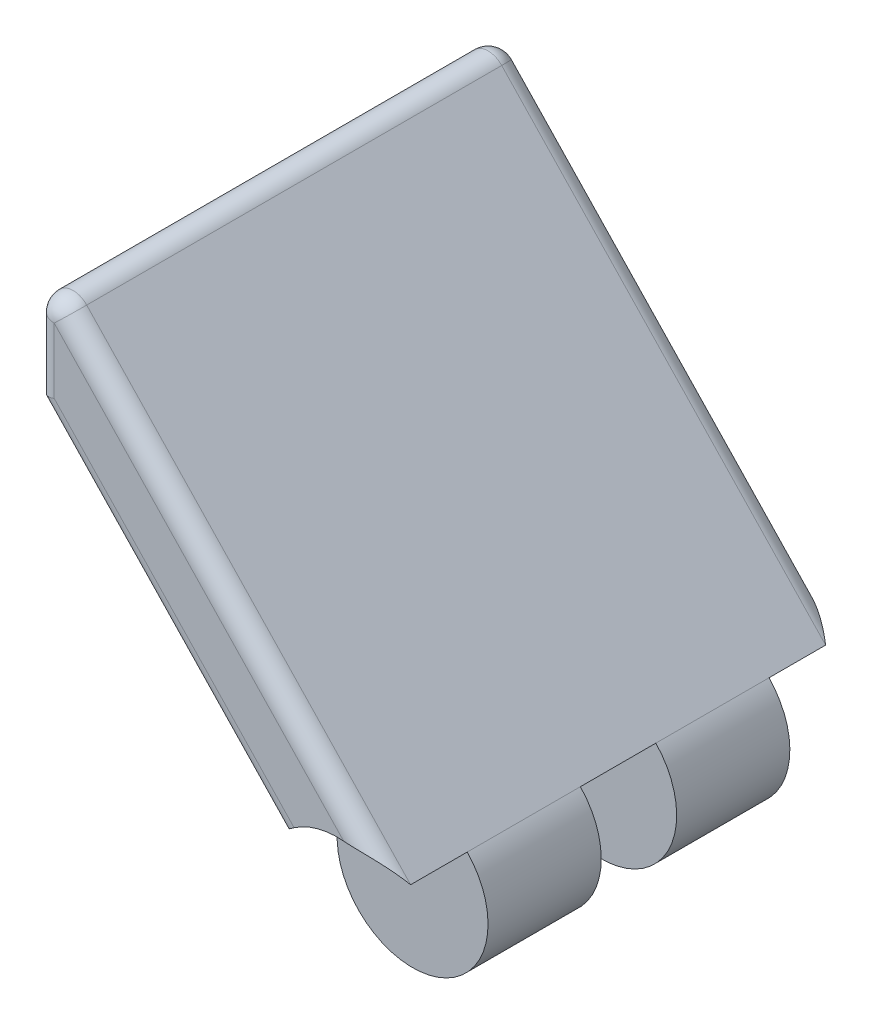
ISO-10303-21;
HEADER;
FILE_DESCRIPTION(('STEP AP214'),'2;1');
FILE_NAME('part.step','',(''),(''),'','','');
FILE_SCHEMA(('AUTOMOTIVE_DESIGN { 1 0 10303 214 1 1 1 1 }'));
ENDSEC;
DATA;
#1=APPLICATION_CONTEXT('core data for automotive mechanical design processes');
#2=APPLICATION_PROTOCOL_DEFINITION('international standard','automotive_design',2000,#1);
#3=PRODUCT_CONTEXT('',#1,'mechanical');
#4=PRODUCT('Part','Part','',(#3));
#5=PRODUCT_RELATED_PRODUCT_CATEGORY('part','',(#4));
#6=PRODUCT_DEFINITION_FORMATION('','',#4);
#7=PRODUCT_DEFINITION_CONTEXT('part definition',#1,'design');
#8=PRODUCT_DEFINITION('design','',#6,#7);
#9=PRODUCT_DEFINITION_SHAPE('','',#8);
#10=(LENGTH_UNIT() NAMED_UNIT(*) SI_UNIT(.MILLI.,.METRE.));
#11=(NAMED_UNIT(*) PLANE_ANGLE_UNIT() SI_UNIT($,.RADIAN.));
#12=(NAMED_UNIT(*) SI_UNIT($,.STERADIAN.) SOLID_ANGLE_UNIT());
#13=UNCERTAINTY_MEASURE_WITH_UNIT(LENGTH_MEASURE(1.E-05),#10,'distance_accuracy_value','');
#14=(GEOMETRIC_REPRESENTATION_CONTEXT(3) GLOBAL_UNCERTAINTY_ASSIGNED_CONTEXT((#13)) GLOBAL_UNIT_ASSIGNED_CONTEXT((#10,
#11,#12)) REPRESENTATION_CONTEXT('',''));
#15=CARTESIAN_POINT('',(0.,0.,0.));
#16=DIRECTION('',(0.,0.,1.));
#17=DIRECTION('',(1.,0.,0.));
#18=AXIS2_PLACEMENT_3D('',#15,#16,#17);
#19=CARTESIAN_POINT('',(98.5993510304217,228.596126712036,15.24));
#20=DIRECTION('',(0.,0.,-1.));
#21=DIRECTION('',(-1.,0.,0.));
#22=AXIS2_PLACEMENT_3D('',#19,#20,#21);
#23=CYLINDRICAL_SURFACE('',#22,5.08000000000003);
#24=CARTESIAN_POINT('',(98.5993510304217,228.596126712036,10.16));
#25=DIRECTION('',(0.,0.,1.));
#26=DIRECTION('',(1.,0.,0.));
#27=AXIS2_PLACEMENT_3D('',#24,#25,#26);
#28=CIRCLE('',#27,5.08000000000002);
#29=CARTESIAN_POINT('',(94.7579757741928,231.920316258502,10.16));
#30=VERTEX_POINT('',#29);
#31=CARTESIAN_POINT('',(102.277439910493,232.100133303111,10.16));
#32=VERTEX_POINT('',#31);
#33=EDGE_CURVE('E140',#30,#32,#28,.T.);
#34=ORIENTED_EDGE('',*,*,#33,.F.);
#35=DIRECTION('',(0.,0.,-1.));
#36=VECTOR('',#35,1.);
#37=CARTESIAN_POINT('',(94.7579757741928,231.920316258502,15.24));
#38=LINE('',#37,#36);
#39=CARTESIAN_POINT('',(94.7579757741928,231.920316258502,2.54));
#40=VERTEX_POINT('',#39);
#41=EDGE_CURVE('E58',#30,#40,#38,.T.);
#42=ORIENTED_EDGE('',*,*,#41,.T.);
#43=CARTESIAN_POINT('',(98.5993510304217,228.596126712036,2.54));
#44=DIRECTION('',(0.,0.,1.));
#45=DIRECTION('',(1.,0.,0.));
#46=AXIS2_PLACEMENT_3D('',#43,#44,#45);
#47=CIRCLE('',#46,5.08000000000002);
#48=CARTESIAN_POINT('',(102.277439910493,232.100133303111,2.54));
#49=VERTEX_POINT('',#48);
#50=EDGE_CURVE('E259',#40,#49,#47,.T.);
#51=ORIENTED_EDGE('',*,*,#50,.T.);
#52=DIRECTION('',(0.,0.,-1.));
#53=VECTOR('',#52,1.);
#54=CARTESIAN_POINT('',(102.277439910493,232.100133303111,15.24));
#55=LINE('',#54,#53);
#56=EDGE_CURVE('E161',#32,#49,#55,.T.);
#57=ORIENTED_EDGE('',*,*,#56,.F.);
#58=EDGE_LOOP('',(#34,#42,#51,#57));
#59=FACE_BOUND('',#58,.T.);
#60=ADVANCED_FACE('F30',(#59),#23,.T.);
#61=CARTESIAN_POINT('',(98.5993510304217,228.596126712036,15.24));
#62=DIRECTION('',(0.,0.,1.));
#63=DIRECTION('',(1.,0.,0.));
#64=AXIS2_PLACEMENT_3D('',#61,#62,#63);
#65=PLANE('',#64);
#66=DIRECTION('',(0.689765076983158,-0.724033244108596,0.));
#67=VECTOR('',#66,1.);
#68=CARTESIAN_POINT('',(95.6774979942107,232.79631790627,15.24));
#69=LINE('',#68,#67);
#70=CARTESIAN_POINT('',(79.5493510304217,249.725726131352,15.24));
#71=VERTEX_POINT('',#70);
#72=CARTESIAN_POINT('',(95.7029932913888,232.769555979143,15.24));
#73=VERTEX_POINT('',#72);
#74=EDGE_CURVE('E183',#71,#73,#69,.T.);
#75=ORIENTED_EDGE('',*,*,#74,.T.);
#76=CARTESIAN_POINT('',(98.5993510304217,228.596126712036,15.24));
#77=DIRECTION('',(0.,0.,1.));
#78=DIRECTION('',(1.,0.,0.));
#79=AXIS2_PLACEMENT_3D('',#76,#77,#78);
#80=CIRCLE('',#79,5.08000000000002);
#81=CARTESIAN_POINT('',(99.040235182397,233.656958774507,15.24));
#82=VERTEX_POINT('',#81);
#83=EDGE_CURVE('E244',#73,#82,#80,.F.);
#84=ORIENTED_EDGE('',*,*,#83,.T.);
#85=DIRECTION('',(-0.689765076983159,0.724033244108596,0.));
#86=VECTOR('',#85,1.);
#87=CARTESIAN_POINT('',(77.3598288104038,256.414467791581,15.24));
#88=LINE('',#87,#86);
#89=CARTESIAN_POINT('',(79.5493510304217,254.116168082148,15.24));
#90=VERTEX_POINT('',#89);
#91=EDGE_CURVE('E181',#82,#90,#88,.T.);
#92=ORIENTED_EDGE('',*,*,#91,.T.);
#93=DIRECTION('',(0.,-1.,0.));
#94=VECTOR('',#93,1.);
#95=CARTESIAN_POINT('',(79.5493510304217,249.217614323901,15.24));
#96=LINE('',#95,#94);
#97=EDGE_CURVE('E179',#90,#71,#96,.T.);
#98=ORIENTED_EDGE('',*,*,#97,.T.);
#99=EDGE_LOOP('',(#75,#84,#92,#98));
#100=FACE_BOUND('',#99,.T.);
#101=ADVANCED_FACE('F275',(#100),#65,.T.);
#102=CARTESIAN_POINT('',(99.1652745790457,229.135265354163,13.97));
#103=DIRECTION('',(-0.689765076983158,0.724033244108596,0.));
#104=DIRECTION('',(-0.724033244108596,-0.689765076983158,0.));
#105=AXIS2_PLACEMENT_3D('',#102,#103,#104);
#106=CYLINDRICAL_SURFACE('',#105,1.27);
#107=DIRECTION('',(0.689765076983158,-0.724033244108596,0.));
#108=VECTOR('',#107,1.);
#109=CARTESIAN_POINT('',(78.2793510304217,249.217614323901,13.97));
#110=LINE('',#109,#108);
#111=CARTESIAN_POINT('',(94.7579757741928,231.920316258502,13.97));
#112=VERTEX_POINT('',#111);
#113=CARTESIAN_POINT('',(78.2793510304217,249.217614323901,13.97));
#114=VERTEX_POINT('',#113);
#115=EDGE_CURVE('E189',#112,#114,#110,.F.);
#116=ORIENTED_EDGE('',*,*,#115,.F.);
#117=CARTESIAN_POINT('',(94.7579757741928,231.920316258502,13.97));
#118=CARTESIAN_POINT('',(94.7579773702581,231.920314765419,14.0056818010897));
#119=CARTESIAN_POINT('',(94.7589648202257,231.921459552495,14.0413463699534));
#120=CARTESIAN_POINT('',(94.7629135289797,231.926015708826,14.1124178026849));
#121=CARTESIAN_POINT('',(94.7658746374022,231.929426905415,14.1478246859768));
#122=CARTESIAN_POINT('',(94.7777070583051,231.943004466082,14.2532006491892));
#123=CARTESIAN_POINT('',(94.7895274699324,231.95651500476,14.3224601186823));
#124=CARTESIAN_POINT('',(94.8209512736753,231.991807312,14.4569776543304));
#125=CARTESIAN_POINT('',(94.8405574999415,232.013592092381,14.5222342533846));
#126=CARTESIAN_POINT('',(94.8873950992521,232.064407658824,14.6469379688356));
#127=CARTESIAN_POINT('',(94.9146261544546,232.093438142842,14.7063853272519));
#128=CARTESIAN_POINT('',(94.9765193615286,232.157513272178,14.8179412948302));
#129=CARTESIAN_POINT('',(95.0112006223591,232.192573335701,14.8700304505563));
#130=CARTESIAN_POINT('',(95.0875011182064,232.267113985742,14.9651983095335));
#131=CARTESIAN_POINT('',(95.1291204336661,232.306594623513,15.008276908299));
#132=CARTESIAN_POINT('',(95.2182040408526,232.387940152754,15.0838430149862));
#133=CARTESIAN_POINT('',(95.2656163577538,232.429782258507,15.1164163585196));
#134=CARTESIAN_POINT('',(95.3655650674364,232.514456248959,15.1705309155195));
#135=CARTESIAN_POINT('',(95.4180989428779,232.557287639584,15.1920775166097));
#136=CARTESIAN_POINT('',(95.5095150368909,232.628684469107,15.2185648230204));
#137=CARTESIAN_POINT('',(95.5473888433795,232.657430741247,15.2266126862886));
#138=CARTESIAN_POINT('',(95.624369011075,232.714159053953,15.2373316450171));
#139=CARTESIAN_POINT('',(95.6634736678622,232.742142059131,15.2400098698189));
#140=CARTESIAN_POINT('',(95.7029932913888,232.769555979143,15.24));
#141=B_SPLINE_CURVE_WITH_KNOTS('',3,(#117,#118,#119,#120,#121,#122,#123,#124,#125,#126,#127,
#128,#129,#130,#131,#132,#133,#134,#135,#136,#137,#138,#139,#140),.UNSPECIFIED.,.F.,.F.,(4,2,2,
2,2,2,2,2,2,2,2,4),(0.,0.106979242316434,0.213950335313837,0.427492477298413,0.641112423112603,
0.854723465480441,1.06888908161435,1.28305718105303,1.49542822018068,1.70769539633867,
1.85206394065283,1.99624067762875),.UNSPECIFIED.);
#142=EDGE_CURVE('E239',#112,#73,#141,.T.);
#143=ORIENTED_EDGE('',*,*,#142,.T.);
#144=ORIENTED_EDGE('',*,*,#74,.F.);
#145=CARTESIAN_POINT('',(79.5493510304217,249.725726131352,13.97));
#146=DIRECTION('',(-0.371461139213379,0.928448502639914,0.));
#147=DIRECTION('',(0.928448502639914,0.371461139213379,0.));
#148=AXIS2_PLACEMENT_3D('',#145,#146,#147);
#149=ELLIPSE('',#148,1.36787338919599,1.27);
#150=EDGE_CURVE('E222',#114,#71,#149,.T.);
#151=ORIENTED_EDGE('',*,*,#150,.F.);
#152=EDGE_LOOP('',(#116,#143,#144,#151));
#153=FACE_BOUND('',#152,.T.);
#154=ADVANCED_FACE('F32',(#153),#106,.T.);
#155=CARTESIAN_POINT('',(101.357917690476,231.224131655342,13.97));
#156=DIRECTION('',(0.689765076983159,-0.724033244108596,0.));
#157=DIRECTION('',(0.724033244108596,0.689765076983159,0.));
#158=AXIS2_PLACEMENT_3D('',#155,#156,#157);
#159=CYLINDRICAL_SURFACE('',#158,1.27);
#160=ORIENTED_EDGE('',*,*,#91,.F.);
#161=CARTESIAN_POINT('',(99.040235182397,233.656958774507,15.24));
#162=CARTESIAN_POINT('',(99.1226288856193,233.649793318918,15.2399717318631));
#163=CARTESIAN_POINT('',(99.2047623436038,233.640598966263,15.2364677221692));
#164=CARTESIAN_POINT('',(99.3678762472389,233.618327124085,15.2234949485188));
#165=CARTESIAN_POINT('',(99.4488586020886,233.605257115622,15.2140376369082));
#166=CARTESIAN_POINT('',(99.6087075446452,233.575500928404,15.1902341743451));
#167=CARTESIAN_POINT('',(99.6875859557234,233.55884489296,15.1759282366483));
#168=CARTESIAN_POINT('',(99.8436839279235,233.522024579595,15.143162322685));
#169=CARTESIAN_POINT('',(99.9209023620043,233.501857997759,15.1246996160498));
#170=CARTESIAN_POINT('',(100.115913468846,233.4460429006,15.0730310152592));
#171=CARTESIAN_POINT('',(100.232375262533,233.408023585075,15.0373378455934));
#172=CARTESIAN_POINT('',(100.460340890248,233.324537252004,14.9594672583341));
#173=CARTESIAN_POINT('',(100.57184296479,233.279067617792,14.9172875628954));
#174=CARTESIAN_POINT('',(100.790239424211,233.180972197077,14.8277485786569));
#175=CARTESIAN_POINT('',(100.89710789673,233.128311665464,14.7803643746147));
#176=CARTESIAN_POINT('',(101.105511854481,233.016481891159,14.6818397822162));
#177=CARTESIAN_POINT('',(101.207048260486,232.957313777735,14.6307000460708));
#178=CARTESIAN_POINT('',(101.48412254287,232.782874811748,14.4835313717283));
#179=CARTESIAN_POINT('',(101.653693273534,232.660670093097,14.3843977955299));
#180=CARTESIAN_POINT('',(101.974738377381,232.39823305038,14.18228001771));
#181=CARTESIAN_POINT('',(102.126261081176,232.258051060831,14.0793071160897));
#182=CARTESIAN_POINT('',(102.271573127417,232.106283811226,13.9742499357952));
#183=CARTESIAN_POINT('',(102.274508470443,232.103210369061,13.9721249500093));
#184=CARTESIAN_POINT('',(102.277439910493,232.100133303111,13.97));
#185=B_SPLINE_CURVE_WITH_KNOTS('',3,(#161,#162,#163,#164,#165,#166,#167,#168,#169,#170,#171,
#172,#173,#174,#175,#176,#177,#178,#179,#180,#181,#182,#183,#184),.UNSPECIFIED.,.F.,.F.,(4,2,2,
2,2,2,2,2,2,2,2,4),(0.,0.247897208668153,0.495318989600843,0.74073698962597,0.986316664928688,
1.36854244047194,1.75090274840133,2.13518062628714,2.51939192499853,3.21177398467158,
3.90225812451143,3.91651295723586),.UNSPECIFIED.);
#186=CARTESIAN_POINT('',(102.277439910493,232.100133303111,13.97));
#187=VERTEX_POINT('',#186);
#188=EDGE_CURVE('E11',#82,#187,#185,.T.);
#189=ORIENTED_EDGE('',*,*,#188,.T.);
#190=DIRECTION('',(-0.689765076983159,0.724033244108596,0.));
#191=VECTOR('',#190,1.);
#192=CARTESIAN_POINT('',(102.277439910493,232.100133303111,13.97));
#193=LINE('',#192,#191);
#194=CARTESIAN_POINT('',(80.4688732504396,254.992169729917,13.97));
#195=VERTEX_POINT('',#194);
#196=EDGE_CURVE('E199',#195,#187,#193,.F.);
#197=ORIENTED_EDGE('',*,*,#196,.F.);
#198=CARTESIAN_POINT('',(79.5493510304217,254.116168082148,13.97));
#199=DIRECTION('',(-0.689765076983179,0.724033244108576,0.));
#200=DIRECTION('',(-0.724033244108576,-0.689765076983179,0.));
#201=AXIS2_PLACEMENT_3D('',#198,#199,#200);
#202=CIRCLE('',#201,1.27);
#203=EDGE_CURVE('E220',#90,#195,#202,.T.);
#204=ORIENTED_EDGE('',*,*,#203,.F.);
#205=EDGE_LOOP('',(#160,#189,#197,#204));
#206=FACE_BOUND('',#205,.T.);
#207=ADVANCED_FACE('F285',(#206),#159,.T.);
#208=CARTESIAN_POINT('',(94.7579757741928,231.920316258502,-2.54));
#209=VERTEX_POINT('',#208);
#210=CARTESIAN_POINT('',(94.7579757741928,231.920316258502,-10.16));
#211=VERTEX_POINT('',#210);
#212=EDGE_CURVE('E156',#209,#211,#38,.T.);
#213=ORIENTED_EDGE('',*,*,#212,.T.);
#214=CARTESIAN_POINT('',(98.5993510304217,228.596126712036,-10.16));
#215=DIRECTION('',(0.,0.,1.));
#216=DIRECTION('',(1.,0.,0.));
#217=AXIS2_PLACEMENT_3D('',#214,#215,#216);
#218=CIRCLE('',#217,5.08000000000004);
#219=CARTESIAN_POINT('',(102.277439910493,232.100133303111,-10.16));
#220=VERTEX_POINT('',#219);
#221=EDGE_CURVE('E146',#211,#220,#218,.T.);
#222=ORIENTED_EDGE('',*,*,#221,.T.);
#223=CARTESIAN_POINT('',(102.277439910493,232.100133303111,-2.54));
#224=VERTEX_POINT('',#223);
#225=EDGE_CURVE('E153',#224,#220,#55,.T.);
#226=ORIENTED_EDGE('',*,*,#225,.F.);
#227=CARTESIAN_POINT('',(98.5993510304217,228.596126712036,-2.54));
#228=DIRECTION('',(0.,0.,1.));
#229=DIRECTION('',(1.,0.,0.));
#230=AXIS2_PLACEMENT_3D('',#227,#228,#229);
#231=CIRCLE('',#230,5.08000000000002);
#232=EDGE_CURVE('E258',#209,#224,#231,.T.);
#233=ORIENTED_EDGE('',*,*,#232,.F.);
#234=EDGE_LOOP('',(#213,#222,#226,#233));
#235=FACE_BOUND('',#234,.T.);
#236=ADVANCED_FACE('F151',(#235),#23,.T.);
#237=CARTESIAN_POINT('',(102.277439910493,232.100133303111,15.24));
#238=DIRECTION('',(-0.724033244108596,-0.689765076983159,0.));
#239=DIRECTION('',(0.689765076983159,-0.724033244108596,0.));
#240=AXIS2_PLACEMENT_3D('',#237,#238,#239);
#241=PLANE('',#240);
#242=EDGE_CURVE('E164',#187,#32,#55,.T.);
#243=ORIENTED_EDGE('',*,*,#242,.T.);
#244=ORIENTED_EDGE('',*,*,#56,.T.);
#245=DIRECTION('',(0.,0.,-1.));
#246=VECTOR('',#245,1.);
#247=CARTESIAN_POINT('',(102.277439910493,232.100133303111,2.54));
#248=LINE('',#247,#246);
#249=EDGE_CURVE('E160',#224,#49,#248,.F.);
#250=ORIENTED_EDGE('',*,*,#249,.F.);
#251=ORIENTED_EDGE('',*,*,#225,.T.);
#252=DIRECTION('',(0.,0.,1.));
#253=VECTOR('',#252,1.);
#254=CARTESIAN_POINT('',(102.277439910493,232.100133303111,-15.3468651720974));
#255=LINE('',#254,#253);
#256=CARTESIAN_POINT('',(102.277439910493,232.100133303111,-13.97));
#257=VERTEX_POINT('',#256);
#258=EDGE_CURVE('E131',#257,#220,#255,.T.);
#259=ORIENTED_EDGE('',*,*,#258,.F.);
#260=DIRECTION('',(-0.689765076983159,0.724033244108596,0.));
#261=VECTOR('',#260,1.);
#262=CARTESIAN_POINT('',(102.277439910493,232.100133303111,-13.97));
#263=LINE('',#262,#261);
#264=CARTESIAN_POINT('',(80.4688732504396,254.992169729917,-13.97));
#265=VERTEX_POINT('',#264);
#266=EDGE_CURVE('E43',#257,#265,#263,.T.);
#267=ORIENTED_EDGE('',*,*,#266,.T.);
#268=DIRECTION('',(0.,0.,-1.));
#269=VECTOR('',#268,1.);
#270=CARTESIAN_POINT('',(80.4688732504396,254.992169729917,15.24));
#271=LINE('',#270,#269);
#272=EDGE_CURVE('E197',#265,#195,#271,.F.);
#273=ORIENTED_EDGE('',*,*,#272,.T.);
#274=ORIENTED_EDGE('',*,*,#196,.T.);
#275=EDGE_LOOP('',(#243,#244,#250,#251,#259,#267,#273,#274));
#276=FACE_BOUND('',#275,.T.);
#277=ADVANCED_FACE('F158',(#276),#241,.F.);
#278=CARTESIAN_POINT('',(78.2793510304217,257.29046943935,15.24));
#279=DIRECTION('',(1.,0.,0.));
#280=DIRECTION('',(0.,1.,0.));
#281=AXIS2_PLACEMENT_3D('',#278,#279,#280);
#282=PLANE('',#281);
#283=DIRECTION('',(0.,0.,-1.));
#284=VECTOR('',#283,1.);
#285=CARTESIAN_POINT('',(78.2793510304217,254.116168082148,15.24));
#286=LINE('',#285,#284);
#287=CARTESIAN_POINT('',(78.2793510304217,254.116168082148,13.97));
#288=VERTEX_POINT('',#287);
#289=CARTESIAN_POINT('',(78.2793510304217,254.116168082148,-13.97));
#290=VERTEX_POINT('',#289);
#291=EDGE_CURVE('E191',#288,#290,#286,.T.);
#292=ORIENTED_EDGE('',*,*,#291,.T.);
#293=DIRECTION('',(0.,-1.,0.));
#294=VECTOR('',#293,1.);
#295=CARTESIAN_POINT('',(78.2793510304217,257.29046943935,-13.97));
#296=LINE('',#295,#294);
#297=CARTESIAN_POINT('',(78.2793510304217,249.217614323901,-13.97));
#298=VERTEX_POINT('',#297);
#299=EDGE_CURVE('E195',#290,#298,#296,.T.);
#300=ORIENTED_EDGE('',*,*,#299,.T.);
#301=DIRECTION('',(0.,0.,-1.));
#302=VECTOR('',#301,1.);
#303=CARTESIAN_POINT('',(78.2793510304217,249.217614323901,15.24));
#304=LINE('',#303,#302);
#305=EDGE_CURVE('E162',#114,#298,#304,.T.);
#306=ORIENTED_EDGE('',*,*,#305,.F.);
#307=DIRECTION('',(0.,-1.,0.));
#308=VECTOR('',#307,1.);
#309=CARTESIAN_POINT('',(78.2793510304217,257.29046943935,13.97));
#310=LINE('',#309,#308);
#311=EDGE_CURVE('E193',#114,#288,#310,.F.);
#312=ORIENTED_EDGE('',*,*,#311,.T.);
#313=EDGE_LOOP('',(#292,#300,#306,#312));
#314=FACE_BOUND('',#313,.T.);
#315=ADVANCED_FACE('F290',(#314),#282,.F.);
#316=CARTESIAN_POINT('',(94.7579757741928,231.920316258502,15.24));
#317=DIRECTION('',(0.724033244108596,0.689765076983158,0.));
#318=DIRECTION('',(-0.689765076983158,0.724033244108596,0.));
#319=AXIS2_PLACEMENT_3D('',#316,#317,#318);
#320=PLANE('',#319);
#321=EDGE_CURVE('E166',#112,#30,#38,.T.);
#322=ORIENTED_EDGE('',*,*,#321,.F.);
#323=ORIENTED_EDGE('',*,*,#115,.T.);
#324=ORIENTED_EDGE('',*,*,#305,.T.);
#325=DIRECTION('',(0.689765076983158,-0.724033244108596,0.));
#326=VECTOR('',#325,1.);
#327=CARTESIAN_POINT('',(94.7579757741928,231.920316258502,-13.97));
#328=LINE('',#327,#326);
#329=CARTESIAN_POINT('',(94.7579757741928,231.920316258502,-13.97));
#330=VERTEX_POINT('',#329);
#331=EDGE_CURVE('E186',#298,#330,#328,.T.);
#332=ORIENTED_EDGE('',*,*,#331,.T.);
#333=DIRECTION('',(0.,0.,1.));
#334=VECTOR('',#333,1.);
#335=CARTESIAN_POINT('',(94.7579757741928,231.920316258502,-15.3468651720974));
#336=LINE('',#335,#334);
#337=EDGE_CURVE('E141',#330,#211,#336,.T.);
#338=ORIENTED_EDGE('',*,*,#337,.T.);
#339=ORIENTED_EDGE('',*,*,#212,.F.);
#340=EDGE_CURVE('E228',#40,#209,#38,.T.);
#341=ORIENTED_EDGE('',*,*,#340,.F.);
#342=ORIENTED_EDGE('',*,*,#41,.F.);
#343=EDGE_LOOP('',(#322,#323,#324,#332,#338,#339,#341,#342));
#344=FACE_BOUND('',#343,.T.);
#345=ADVANCED_FACE('F247',(#344),#320,.F.);
#346=CARTESIAN_POINT('',(98.5993510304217,228.596126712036,-15.24));
#347=DIRECTION('',(0.,0.,1.));
#348=DIRECTION('',(1.,0.,0.));
#349=AXIS2_PLACEMENT_3D('',#346,#347,#348);
#350=PLANE('',#349);
#351=DIRECTION('',(-0.689765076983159,0.724033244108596,0.));
#352=VECTOR('',#351,1.);
#353=CARTESIAN_POINT('',(101.357917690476,231.224131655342,-15.24));
#354=LINE('',#353,#352);
#355=CARTESIAN_POINT('',(79.5493510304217,254.116168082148,-15.24));
#356=VERTEX_POINT('',#355);
#357=CARTESIAN_POINT('',(99.040235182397,233.656958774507,-15.24));
#358=VERTEX_POINT('',#357);
#359=EDGE_CURVE('E169',#356,#358,#354,.F.);
#360=ORIENTED_EDGE('',*,*,#359,.T.);
#361=CARTESIAN_POINT('',(98.5993510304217,228.596126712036,-15.24));
#362=DIRECTION('',(0.,0.,1.));
#363=DIRECTION('',(1.,0.,0.));
#364=AXIS2_PLACEMENT_3D('',#361,#362,#363);
#365=CIRCLE('',#364,5.08000000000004);
#366=CARTESIAN_POINT('',(95.7029932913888,232.769555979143,-15.24));
#367=VERTEX_POINT('',#366);
#368=EDGE_CURVE('E50',#358,#367,#365,.T.);
#369=ORIENTED_EDGE('',*,*,#368,.T.);
#370=DIRECTION('',(0.689765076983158,-0.724033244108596,0.));
#371=VECTOR('',#370,1.);
#372=CARTESIAN_POINT('',(99.1652745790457,229.135265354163,-15.24));
#373=LINE('',#372,#371);
#374=CARTESIAN_POINT('',(79.5493510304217,249.725726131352,-15.24));
#375=VERTEX_POINT('',#374);
#376=EDGE_CURVE('E175',#367,#375,#373,.F.);
#377=ORIENTED_EDGE('',*,*,#376,.T.);
#378=DIRECTION('',(0.,-1.,0.));
#379=VECTOR('',#378,1.);
#380=CARTESIAN_POINT('',(79.5493510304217,228.596126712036,-15.24));
#381=LINE('',#380,#379);
#382=EDGE_CURVE('E172',#375,#356,#381,.F.);
#383=ORIENTED_EDGE('',*,*,#382,.T.);
#384=EDGE_LOOP('',(#360,#369,#377,#383));
#385=FACE_BOUND('',#384,.T.);
#386=ADVANCED_FACE('F303',(#385),#350,.F.);
#387=CARTESIAN_POINT('',(79.5493510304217,228.596126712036,13.97));
#388=DIRECTION('',(0.,1.,0.));
#389=DIRECTION('',(-1.,0.,0.));
#390=AXIS2_PLACEMENT_3D('',#387,#388,#389);
#391=CYLINDRICAL_SURFACE('',#390,1.27);
#392=ORIENTED_EDGE('',*,*,#150,.T.);
#393=ORIENTED_EDGE('',*,*,#97,.F.);
#394=CARTESIAN_POINT('',(79.5493510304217,254.116168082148,13.97));
#395=DIRECTION('',(0.,1.,0.));
#396=DIRECTION('',(0.,0.,1.));
#397=AXIS2_PLACEMENT_3D('',#394,#395,#396);
#398=CIRCLE('',#397,1.27);
#399=EDGE_CURVE('E217',#288,#90,#398,.T.);
#400=ORIENTED_EDGE('',*,*,#399,.F.);
#401=ORIENTED_EDGE('',*,*,#311,.F.);
#402=EDGE_LOOP('',(#392,#393,#400,#401));
#403=FACE_BOUND('',#402,.T.);
#404=ADVANCED_FACE('F299',(#403),#391,.T.);
#405=CARTESIAN_POINT('',(79.5493510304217,254.116168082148,13.97));
#406=DIRECTION('',(0.,0.,1.));
#407=DIRECTION('',(1.,0.,0.));
#408=AXIS2_PLACEMENT_3D('',#405,#406,#407);
#409=SPHERICAL_SURFACE('',#408,1.27);
#410=ORIENTED_EDGE('',*,*,#399,.T.);
#411=ORIENTED_EDGE('',*,*,#203,.T.);
#412=CARTESIAN_POINT('',(79.5493510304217,254.116168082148,13.97));
#413=DIRECTION('',(0.,0.,1.));
#414=DIRECTION('',(1.,0.,0.));
#415=AXIS2_PLACEMENT_3D('',#412,#413,#414);
#416=CIRCLE('',#415,1.27);
#417=EDGE_CURVE('E214',#288,#195,#416,.F.);
#418=ORIENTED_EDGE('',*,*,#417,.F.);
#419=EDGE_LOOP('',(#410,#411,#418));
#420=FACE_BOUND('',#419,.T.);
#421=ADVANCED_FACE('F302',(#420),#409,.T.);
#422=CARTESIAN_POINT('',(79.5493510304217,254.116168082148,15.24));
#423=DIRECTION('',(0.,0.,-1.));
#424=DIRECTION('',(-1.,0.,0.));
#425=AXIS2_PLACEMENT_3D('',#422,#423,#424);
#426=CYLINDRICAL_SURFACE('',#425,1.27);
#427=ORIENTED_EDGE('',*,*,#417,.T.);
#428=ORIENTED_EDGE('',*,*,#272,.F.);
#429=CARTESIAN_POINT('',(79.5493510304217,254.116168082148,-13.97));
#430=DIRECTION('',(0.,0.,-1.));
#431=DIRECTION('',(-1.,0.,0.));
#432=AXIS2_PLACEMENT_3D('',#429,#430,#431);
#433=CIRCLE('',#432,1.27);
#434=EDGE_CURVE('E211',#290,#265,#433,.T.);
#435=ORIENTED_EDGE('',*,*,#434,.F.);
#436=ORIENTED_EDGE('',*,*,#291,.F.);
#437=EDGE_LOOP('',(#427,#428,#435,#436));
#438=FACE_BOUND('',#437,.T.);
#439=ADVANCED_FACE('F306',(#438),#426,.T.);
#440=CARTESIAN_POINT('',(79.5493510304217,257.29046943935,-13.97));
#441=DIRECTION('',(0.,-1.,0.));
#442=DIRECTION('',(1.,0.,0.));
#443=AXIS2_PLACEMENT_3D('',#440,#441,#442);
#444=CYLINDRICAL_SURFACE('',#443,1.27);
#445=CARTESIAN_POINT('',(79.5493510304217,249.725726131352,-13.97));
#446=DIRECTION('',(0.371461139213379,-0.928448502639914,0.));
#447=DIRECTION('',(-0.928448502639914,-0.371461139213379,0.));
#448=AXIS2_PLACEMENT_3D('',#445,#446,#447);
#449=ELLIPSE('',#448,1.36787338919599,1.27);
#450=EDGE_CURVE('E205',#298,#375,#449,.T.);
#451=ORIENTED_EDGE('',*,*,#450,.F.);
#452=ORIENTED_EDGE('',*,*,#299,.F.);
#453=CARTESIAN_POINT('',(79.5493510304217,254.116168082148,-13.97));
#454=DIRECTION('',(0.,1.,0.));
#455=DIRECTION('',(0.,0.,1.));
#456=AXIS2_PLACEMENT_3D('',#453,#454,#455);
#457=CIRCLE('',#456,1.27);
#458=EDGE_CURVE('E208',#356,#290,#457,.T.);
#459=ORIENTED_EDGE('',*,*,#458,.F.);
#460=ORIENTED_EDGE('',*,*,#382,.F.);
#461=EDGE_LOOP('',(#451,#452,#459,#460));
#462=FACE_BOUND('',#461,.T.);
#463=ADVANCED_FACE('F310',(#462),#444,.T.);
#464=CARTESIAN_POINT('',(79.5493510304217,254.116168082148,-13.97));
#465=DIRECTION('',(0.,0.,1.));
#466=DIRECTION('',(1.,0.,0.));
#467=AXIS2_PLACEMENT_3D('',#464,#465,#466);
#468=SPHERICAL_SURFACE('',#467,1.27);
#469=ORIENTED_EDGE('',*,*,#458,.T.);
#470=ORIENTED_EDGE('',*,*,#434,.T.);
#471=CARTESIAN_POINT('',(79.5493510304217,254.116168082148,-13.97));
#472=DIRECTION('',(-0.689765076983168,0.724033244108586,0.));
#473=DIRECTION('',(-0.724033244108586,-0.689765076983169,0.));
#474=AXIS2_PLACEMENT_3D('',#471,#472,#473);
#475=CIRCLE('',#474,1.27);
#476=EDGE_CURVE('E202',#356,#265,#475,.F.);
#477=ORIENTED_EDGE('',*,*,#476,.F.);
#478=EDGE_LOOP('',(#469,#470,#477));
#479=FACE_BOUND('',#478,.T.);
#480=ADVANCED_FACE('F314',(#479),#468,.T.);
#481=CARTESIAN_POINT('',(95.6774979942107,232.79631790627,-13.97));
#482=DIRECTION('',(0.689765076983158,-0.724033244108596,0.));
#483=DIRECTION('',(0.724033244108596,0.689765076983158,0.));
#484=AXIS2_PLACEMENT_3D('',#481,#482,#483);
#485=CYLINDRICAL_SURFACE('',#484,1.27);
#486=CARTESIAN_POINT('',(94.7579757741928,231.920316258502,-13.97));
#487=CARTESIAN_POINT('',(94.7579773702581,231.920314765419,-14.0056818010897));
#488=CARTESIAN_POINT('',(94.7589648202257,231.921459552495,-14.0413463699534));
#489=CARTESIAN_POINT('',(94.7629135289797,231.926015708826,-14.1124178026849));
#490=CARTESIAN_POINT('',(94.7658746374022,231.929426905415,-14.1478246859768));
#491=CARTESIAN_POINT('',(94.7777070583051,231.943004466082,-14.2532006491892));
#492=CARTESIAN_POINT('',(94.7895274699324,231.95651500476,-14.3224601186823));
#493=CARTESIAN_POINT('',(94.8209512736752,231.991807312,-14.4569776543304));
#494=CARTESIAN_POINT('',(94.8405574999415,232.013592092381,-14.5222342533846));
#495=CARTESIAN_POINT('',(94.8873950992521,232.064407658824,-14.6469379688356));
#496=CARTESIAN_POINT('',(94.9146261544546,232.093438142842,-14.7063853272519));
#497=CARTESIAN_POINT('',(94.9765193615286,232.157513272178,-14.8179412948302));
#498=CARTESIAN_POINT('',(95.011200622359,232.192573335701,-14.8700304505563));
#499=CARTESIAN_POINT('',(95.0875011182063,232.267113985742,-14.9651983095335));
#500=CARTESIAN_POINT('',(95.1291204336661,232.306594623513,-15.008276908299));
#501=CARTESIAN_POINT('',(95.2182040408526,232.387940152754,-15.0838430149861));
#502=CARTESIAN_POINT('',(95.2656163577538,232.429782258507,-15.1164163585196));
#503=CARTESIAN_POINT('',(95.3655650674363,232.514456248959,-15.1705309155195));
#504=CARTESIAN_POINT('',(95.4180989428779,232.557287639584,-15.1920775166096));
#505=CARTESIAN_POINT('',(95.5095150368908,232.628684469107,-15.2185648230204));
#506=CARTESIAN_POINT('',(95.5473888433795,232.657430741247,-15.2266126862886));
#507=CARTESIAN_POINT('',(95.624369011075,232.714159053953,-15.2373316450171));
#508=CARTESIAN_POINT('',(95.6634736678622,232.742142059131,-15.2400098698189));
#509=CARTESIAN_POINT('',(95.7029932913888,232.769555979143,-15.24));
#510=B_SPLINE_CURVE_WITH_KNOTS('',3,(#486,#487,#488,#489,#490,#491,#492,#493,#494,#495,#496,
#497,#498,#499,#500,#501,#502,#503,#504,#505,#506,#507,#508,#509),.UNSPECIFIED.,.F.,.F.,(4,2,2,
2,2,2,2,2,2,2,2,4),(0.,0.10697924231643,0.21395033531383,0.427492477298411,0.641112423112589,
0.854723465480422,1.06888908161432,1.28305718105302,1.49542822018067,1.70769539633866,
1.85206394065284,1.99624067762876),.UNSPECIFIED.);
#511=EDGE_CURVE('E330',#330,#367,#510,.T.);
#512=ORIENTED_EDGE('',*,*,#511,.F.);
#513=ORIENTED_EDGE('',*,*,#331,.F.);
#514=ORIENTED_EDGE('',*,*,#450,.T.);
#515=ORIENTED_EDGE('',*,*,#376,.F.);
#516=EDGE_LOOP('',(#512,#513,#514,#515));
#517=FACE_BOUND('',#516,.T.);
#518=ADVANCED_FACE('F318',(#517),#485,.T.);
#519=CARTESIAN_POINT('',(101.357917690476,231.224131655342,-13.97));
#520=DIRECTION('',(-0.689765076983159,0.724033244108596,0.));
#521=DIRECTION('',(-0.724033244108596,-0.689765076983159,0.));
#522=AXIS2_PLACEMENT_3D('',#519,#520,#521);
#523=CYLINDRICAL_SURFACE('',#522,1.27);
#524=CARTESIAN_POINT('',(99.040235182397,233.656958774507,-15.24));
#525=CARTESIAN_POINT('',(99.122628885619,233.649793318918,-15.2399717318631));
#526=CARTESIAN_POINT('',(99.2047623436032,233.640598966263,-15.2364677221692));
#527=CARTESIAN_POINT('',(99.3678762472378,233.618327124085,-15.2234949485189));
#528=CARTESIAN_POINT('',(99.4488586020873,233.605257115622,-15.2140376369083));
#529=CARTESIAN_POINT('',(99.6087075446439,233.575500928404,-15.1902341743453));
#530=CARTESIAN_POINT('',(99.6875859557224,233.558844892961,-15.1759282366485));
#531=CARTESIAN_POINT('',(99.843683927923,233.522024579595,-15.1431623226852));
#532=CARTESIAN_POINT('',(99.920902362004,233.501857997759,-15.1246996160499));
#533=CARTESIAN_POINT('',(100.115913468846,233.4460429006,-15.0730310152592));
#534=CARTESIAN_POINT('',(100.232375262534,233.408023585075,-15.0373378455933));
#535=CARTESIAN_POINT('',(100.460340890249,233.324537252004,-14.9594672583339));
#536=CARTESIAN_POINT('',(100.571842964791,233.279067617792,-14.917287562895));
#537=CARTESIAN_POINT('',(100.790239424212,233.180972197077,-14.8277485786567));
#538=CARTESIAN_POINT('',(100.897107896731,233.128311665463,-14.7803643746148));
#539=CARTESIAN_POINT('',(101.105511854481,233.016481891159,-14.6818397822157));
#540=CARTESIAN_POINT('',(101.207048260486,232.957313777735,-14.6307000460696));
#541=CARTESIAN_POINT('',(101.484122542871,232.782874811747,-14.4835313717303));
#542=CARTESIAN_POINT('',(101.653693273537,232.660670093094,-14.3843977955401));
#543=CARTESIAN_POINT('',(101.974738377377,232.398233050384,-14.1822800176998));
#544=CARTESIAN_POINT('',(102.126261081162,232.258051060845,-14.0793071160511));
#545=CARTESIAN_POINT('',(102.271573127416,232.106283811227,-13.9742499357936));
#546=CARTESIAN_POINT('',(102.274508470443,232.103210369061,-13.9721249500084));
#547=CARTESIAN_POINT('',(102.277439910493,232.100133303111,-13.97));
#548=B_SPLINE_CURVE_WITH_KNOTS('',3,(#524,#525,#526,#527,#528,#529,#530,#531,#532,#533,#534,
#535,#536,#537,#538,#539,#540,#541,#542,#543,#544,#545,#546,#547),.UNSPECIFIED.,.F.,.F.,(4,2,2,
2,2,2,2,2,2,2,2,4),(0.,0.247897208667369,0.495318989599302,0.740736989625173,0.986316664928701,
1.36854244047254,1.75090274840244,2.13518062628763,2.51939192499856,3.21177398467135,
3.90225812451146,3.91651295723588),.UNSPECIFIED.);
#549=EDGE_CURVE('E136',#358,#257,#548,.T.);
#550=ORIENTED_EDGE('',*,*,#549,.F.);
#551=ORIENTED_EDGE('',*,*,#359,.F.);
#552=ORIENTED_EDGE('',*,*,#476,.T.);
#553=ORIENTED_EDGE('',*,*,#266,.F.);
#554=EDGE_LOOP('',(#550,#551,#552,#553));
#555=FACE_BOUND('',#554,.T.);
#556=ADVANCED_FACE('F272',(#555),#523,.T.);
#557=CARTESIAN_POINT('',(98.5993510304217,228.596126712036,2.54));
#558=DIRECTION('',(0.,0.,-1.));
#559=DIRECTION('',(-1.,0.,0.));
#560=AXIS2_PLACEMENT_3D('',#557,#558,#559);
#561=CYLINDRICAL_SURFACE('',#560,5.08000000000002);
#562=ORIENTED_EDGE('',*,*,#249,.T.);
#563=EDGE_CURVE('E254',#49,#40,#47,.T.);
#564=ORIENTED_EDGE('',*,*,#563,.T.);
#565=ORIENTED_EDGE('',*,*,#340,.T.);
#566=EDGE_CURVE('E252',#224,#209,#231,.T.);
#567=ORIENTED_EDGE('',*,*,#566,.F.);
#568=EDGE_LOOP('',(#562,#564,#565,#567));
#569=FACE_BOUND('',#568,.T.);
#570=ADVANCED_FACE('F251',(#569),#561,.F.);
#571=CARTESIAN_POINT('',(98.5993510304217,228.596126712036,2.54));
#572=DIRECTION('',(0.,0.,1.));
#573=DIRECTION('',(1.,0.,0.));
#574=AXIS2_PLACEMENT_3D('',#571,#572,#573);
#575=PLANE('',#574);
#576=ORIENTED_EDGE('',*,*,#563,.F.);
#577=ORIENTED_EDGE('',*,*,#50,.F.);
#578=EDGE_LOOP('',(#576,#577));
#579=FACE_BOUND('',#578,.T.);
#580=ADVANCED_FACE('F264',(#579),#575,.F.);
#581=CARTESIAN_POINT('',(98.5993510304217,228.596126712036,-2.54));
#582=DIRECTION('',(0.,0.,1.));
#583=DIRECTION('',(1.,0.,0.));
#584=AXIS2_PLACEMENT_3D('',#581,#582,#583);
#585=PLANE('',#584);
#586=ORIENTED_EDGE('',*,*,#566,.T.);
#587=ORIENTED_EDGE('',*,*,#232,.T.);
#588=EDGE_LOOP('',(#586,#587));
#589=FACE_BOUND('',#588,.T.);
#590=ADVANCED_FACE('F257',(#589),#585,.T.);
#591=CARTESIAN_POINT('',(98.5993510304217,228.596126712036,15.3468651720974));
#592=DIRECTION('',(0.,0.,-1.));
#593=DIRECTION('',(-1.,0.,0.));
#594=AXIS2_PLACEMENT_3D('',#591,#592,#593);
#595=CYLINDRICAL_SURFACE('',#594,5.08000000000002);
#596=ORIENTED_EDGE('',*,*,#242,.F.);
#597=ORIENTED_EDGE('',*,*,#188,.F.);
#598=ORIENTED_EDGE('',*,*,#83,.F.);
#599=ORIENTED_EDGE('',*,*,#142,.F.);
#600=ORIENTED_EDGE('',*,*,#321,.T.);
#601=EDGE_CURVE('E236',#32,#30,#28,.T.);
#602=ORIENTED_EDGE('',*,*,#601,.F.);
#603=EDGE_LOOP('',(#596,#597,#598,#599,#600,#602));
#604=FACE_BOUND('',#603,.T.);
#605=ADVANCED_FACE('F235',(#604),#595,.F.);
#606=CARTESIAN_POINT('',(98.5993510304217,228.596126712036,10.16));
#607=DIRECTION('',(0.,0.,1.));
#608=DIRECTION('',(1.,0.,0.));
#609=AXIS2_PLACEMENT_3D('',#606,#607,#608);
#610=PLANE('',#609);
#611=ORIENTED_EDGE('',*,*,#601,.T.);
#612=ORIENTED_EDGE('',*,*,#33,.T.);
#613=EDGE_LOOP('',(#611,#612));
#614=FACE_BOUND('',#613,.T.);
#615=ADVANCED_FACE('F243',(#614),#610,.T.);
#616=CARTESIAN_POINT('',(98.5993510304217,228.596126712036,-15.3468651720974));
#617=DIRECTION('',(0.,0.,1.));
#618=DIRECTION('',(1.,0.,0.));
#619=AXIS2_PLACEMENT_3D('',#616,#617,#618);
#620=CYLINDRICAL_SURFACE('',#619,5.08000000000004);
#621=ORIENTED_EDGE('',*,*,#258,.T.);
#622=EDGE_CURVE('E134',#220,#211,#218,.T.);
#623=ORIENTED_EDGE('',*,*,#622,.T.);
#624=ORIENTED_EDGE('',*,*,#337,.F.);
#625=ORIENTED_EDGE('',*,*,#511,.T.);
#626=ORIENTED_EDGE('',*,*,#368,.F.);
#627=ORIENTED_EDGE('',*,*,#549,.T.);
#628=EDGE_LOOP('',(#621,#623,#624,#625,#626,#627));
#629=FACE_BOUND('',#628,.T.);
#630=ADVANCED_FACE('F133',(#629),#620,.F.);
#631=CARTESIAN_POINT('',(98.5993510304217,228.596126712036,-10.16));
#632=DIRECTION('',(0.,0.,1.));
#633=DIRECTION('',(1.,0.,0.));
#634=AXIS2_PLACEMENT_3D('',#631,#632,#633);
#635=PLANE('',#634);
#636=ORIENTED_EDGE('',*,*,#622,.F.);
#637=ORIENTED_EDGE('',*,*,#221,.F.);
#638=EDGE_LOOP('',(#636,#637));
#639=FACE_BOUND('',#638,.T.);
#640=ADVANCED_FACE('F145',(#639),#635,.F.);
#641=CLOSED_SHELL('',(#60,#101,#154,#207,#236,#277,#315,#345,#386,#404,#421,#439,#463,#480,#518,
#556,#570,#580,#590,#605,#615,#630,#640));
#642=MANIFOLD_SOLID_BREP('B2',#641);
#643=ADVANCED_BREP_SHAPE_REPRESENTATION('',(#18,#642),#14);
#644=SHAPE_DEFINITION_REPRESENTATION(#9,#643);
ENDSEC;
END-ISO-10303-21;
